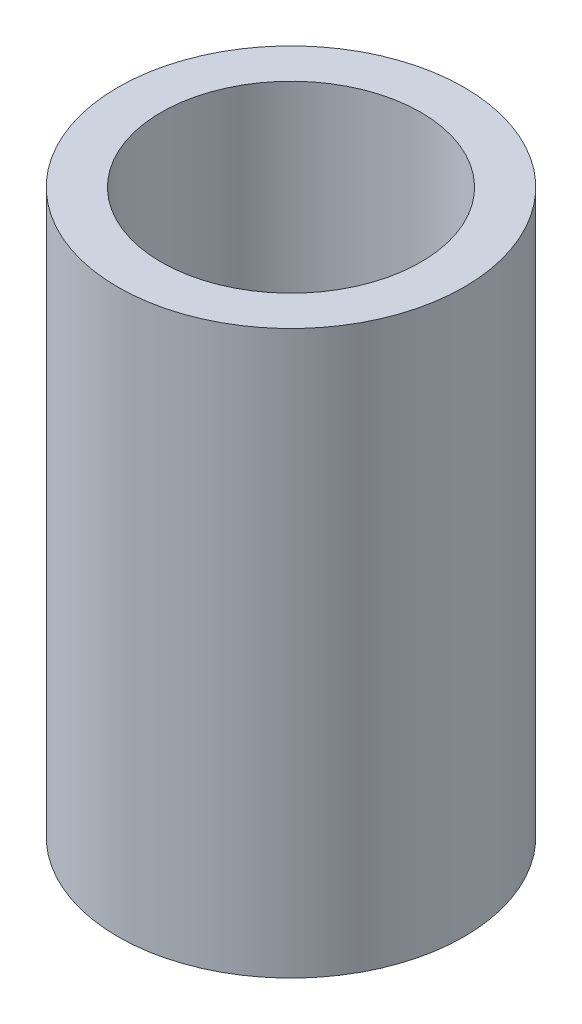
ISO-10303-21;
HEADER;
FILE_DESCRIPTION(('STEP AP214'),'2;1');
FILE_NAME('part.step','',(''),(''),'','','');
FILE_SCHEMA(('AUTOMOTIVE_DESIGN { 1 0 10303 214 1 1 1 1 }'));
ENDSEC;
DATA;
#1=APPLICATION_CONTEXT('core data for automotive mechanical design processes');
#2=APPLICATION_PROTOCOL_DEFINITION('international standard','automotive_design',2000,#1);
#3=PRODUCT_CONTEXT('',#1,'mechanical');
#4=PRODUCT('Part','Part','',(#3));
#5=PRODUCT_RELATED_PRODUCT_CATEGORY('part','',(#4));
#6=PRODUCT_DEFINITION_FORMATION('','',#4);
#7=PRODUCT_DEFINITION_CONTEXT('part definition',#1,'design');
#8=PRODUCT_DEFINITION('design','',#6,#7);
#9=PRODUCT_DEFINITION_SHAPE('','',#8);
#10=(LENGTH_UNIT() NAMED_UNIT(*) SI_UNIT(.MILLI.,.METRE.));
#11=(NAMED_UNIT(*) PLANE_ANGLE_UNIT() SI_UNIT($,.RADIAN.));
#12=(NAMED_UNIT(*) SI_UNIT($,.STERADIAN.) SOLID_ANGLE_UNIT());
#13=UNCERTAINTY_MEASURE_WITH_UNIT(LENGTH_MEASURE(1.E-05),#10,'distance_accuracy_value','');
#14=(GEOMETRIC_REPRESENTATION_CONTEXT(3) GLOBAL_UNCERTAINTY_ASSIGNED_CONTEXT((#13)) GLOBAL_UNIT_ASSIGNED_CONTEXT((#10,
#11,#12)) REPRESENTATION_CONTEXT('',''));
#15=CARTESIAN_POINT('',(0.,0.,0.));
#16=DIRECTION('',(0.,0.,1.));
#17=DIRECTION('',(1.,0.,0.));
#18=AXIS2_PLACEMENT_3D('',#15,#16,#17);
#19=CARTESIAN_POINT('',(0.,19.5,0.));
#20=DIRECTION('',(0.,1.,0.));
#21=DIRECTION('',(0.,0.,1.));
#22=AXIS2_PLACEMENT_3D('',#19,#20,#21);
#23=PLANE('',#22);
#24=CARTESIAN_POINT('',(0.,19.5,0.));
#25=DIRECTION('',(0.,1.,0.));
#26=DIRECTION('',(0.,0.,1.));
#27=AXIS2_PLACEMENT_3D('',#24,#25,#26);
#28=CIRCLE('',#27,12.);
#29=CARTESIAN_POINT('',(0.,19.5,12.));
#30=VERTEX_POINT('',#29);
#31=EDGE_CURVE('E10',#30,#30,#28,.T.);
#32=ORIENTED_EDGE('',*,*,#31,.T.);
#33=EDGE_LOOP('',(#32));
#34=FACE_BOUND('',#33,.T.);
#35=CARTESIAN_POINT('',(0.,19.5,0.));
#36=DIRECTION('',(0.,1.,0.));
#37=DIRECTION('',(0.,0.,1.));
#38=AXIS2_PLACEMENT_3D('',#35,#36,#37);
#39=CIRCLE('',#38,9.);
#40=CARTESIAN_POINT('',(0.,19.5,9.));
#41=VERTEX_POINT('',#40);
#42=EDGE_CURVE('E43',#41,#41,#39,.T.);
#43=ORIENTED_EDGE('',*,*,#42,.F.);
#44=EDGE_LOOP('',(#43));
#45=FACE_BOUND('',#44,.T.);
#46=ADVANCED_FACE('F32',(#34,#45),#23,.T.);
#47=CARTESIAN_POINT('',(0.,-19.5,0.));
#48=DIRECTION('',(0.,1.,0.));
#49=DIRECTION('',(0.,0.,1.));
#50=AXIS2_PLACEMENT_3D('',#47,#48,#49);
#51=PLANE('',#50);
#52=CARTESIAN_POINT('',(0.,-19.5,0.));
#53=DIRECTION('',(0.,1.,0.));
#54=DIRECTION('',(0.,0.,1.));
#55=AXIS2_PLACEMENT_3D('',#52,#53,#54);
#56=CIRCLE('',#55,12.);
#57=CARTESIAN_POINT('',(0.,-19.5,12.));
#58=VERTEX_POINT('',#57);
#59=EDGE_CURVE('E36',#58,#58,#56,.T.);
#60=ORIENTED_EDGE('',*,*,#59,.F.);
#61=EDGE_LOOP('',(#60));
#62=FACE_BOUND('',#61,.T.);
#63=CARTESIAN_POINT('',(0.,-19.5,0.));
#64=DIRECTION('',(0.,1.,0.));
#65=DIRECTION('',(0.,0.,1.));
#66=AXIS2_PLACEMENT_3D('',#63,#64,#65);
#67=CIRCLE('',#66,9.);
#68=CARTESIAN_POINT('',(0.,-19.5,9.));
#69=VERTEX_POINT('',#68);
#70=EDGE_CURVE('E45',#69,#69,#67,.T.);
#71=ORIENTED_EDGE('',*,*,#70,.T.);
#72=EDGE_LOOP('',(#71));
#73=FACE_BOUND('',#72,.T.);
#74=ADVANCED_FACE('F55',(#62,#73),#51,.F.);
#75=CARTESIAN_POINT('',(0.,19.5,0.));
#76=DIRECTION('',(0.,-1.,0.));
#77=DIRECTION('',(0.,0.,-1.));
#78=AXIS2_PLACEMENT_3D('',#75,#76,#77);
#79=CYLINDRICAL_SURFACE('',#78,12.);
#80=ORIENTED_EDGE('',*,*,#31,.F.);
#81=EDGE_LOOP('',(#80));
#82=FACE_BOUND('',#81,.T.);
#83=ORIENTED_EDGE('',*,*,#59,.T.);
#84=EDGE_LOOP('',(#83));
#85=FACE_BOUND('',#84,.T.);
#86=ADVANCED_FACE('F34',(#82,#85),#79,.T.);
#87=CARTESIAN_POINT('',(0.,19.5,0.));
#88=DIRECTION('',(0.,-1.,0.));
#89=DIRECTION('',(0.,0.,-1.));
#90=AXIS2_PLACEMENT_3D('',#87,#88,#89);
#91=CYLINDRICAL_SURFACE('',#90,9.);
#92=ORIENTED_EDGE('',*,*,#42,.T.);
#93=EDGE_LOOP('',(#92));
#94=FACE_BOUND('',#93,.T.);
#95=ORIENTED_EDGE('',*,*,#70,.F.);
#96=EDGE_LOOP('',(#95));
#97=FACE_BOUND('',#96,.T.);
#98=ADVANCED_FACE('F51',(#94,#97),#91,.F.);
#99=CLOSED_SHELL('',(#46,#74,#86,#98));
#100=MANIFOLD_SOLID_BREP('B2',#99);
#101=ADVANCED_BREP_SHAPE_REPRESENTATION('',(#18,#100),#14);
#102=SHAPE_DEFINITION_REPRESENTATION(#9,#101);
ENDSEC;
END-ISO-10303-21;
